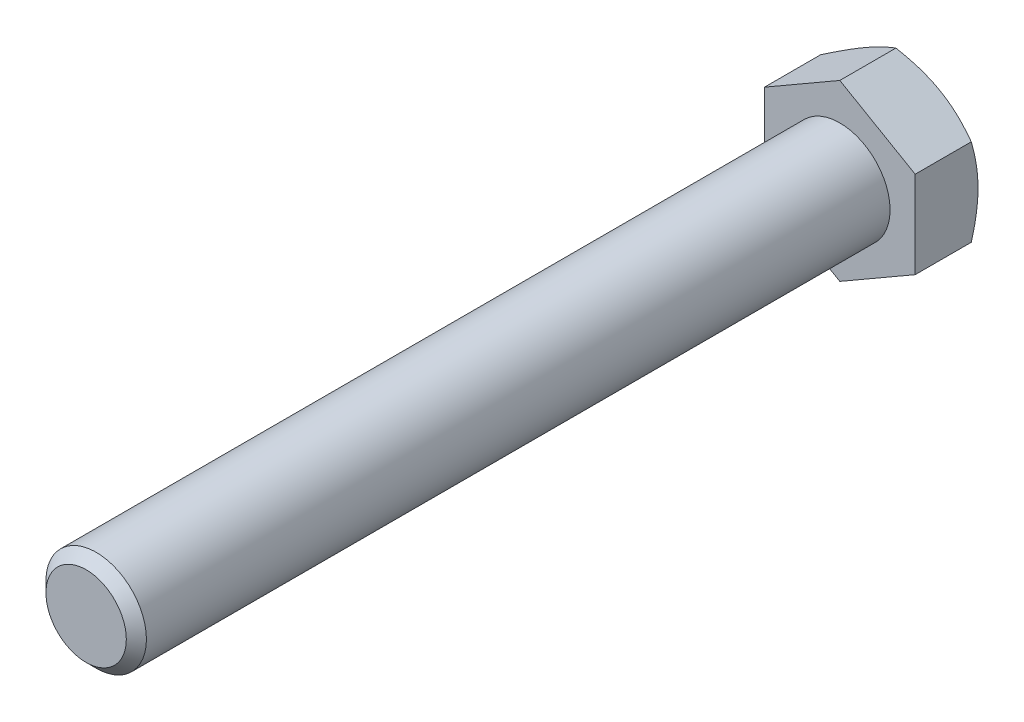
ISO-10303-21;
HEADER;
FILE_DESCRIPTION(('STEP AP214'),'2;1');
FILE_NAME('part.step','',(''),(''),'','','');
FILE_SCHEMA(('AUTOMOTIVE_DESIGN { 1 0 10303 214 1 1 1 1 }'));
ENDSEC;
DATA;
#1=APPLICATION_CONTEXT('core data for automotive mechanical design processes');
#2=APPLICATION_PROTOCOL_DEFINITION('international standard','automotive_design',2000,#1);
#3=PRODUCT_CONTEXT('',#1,'mechanical');
#4=PRODUCT('Part','Part','',(#3));
#5=PRODUCT_RELATED_PRODUCT_CATEGORY('part','',(#4));
#6=PRODUCT_DEFINITION_FORMATION('','',#4);
#7=PRODUCT_DEFINITION_CONTEXT('part definition',#1,'design');
#8=PRODUCT_DEFINITION('design','',#6,#7);
#9=PRODUCT_DEFINITION_SHAPE('','',#8);
#10=(LENGTH_UNIT() NAMED_UNIT(*) SI_UNIT(.MILLI.,.METRE.));
#11=(NAMED_UNIT(*) PLANE_ANGLE_UNIT() SI_UNIT($,.RADIAN.));
#12=(NAMED_UNIT(*) SI_UNIT($,.STERADIAN.) SOLID_ANGLE_UNIT());
#13=UNCERTAINTY_MEASURE_WITH_UNIT(LENGTH_MEASURE(1.E-05),#10,'distance_accuracy_value','');
#14=(GEOMETRIC_REPRESENTATION_CONTEXT(3) GLOBAL_UNCERTAINTY_ASSIGNED_CONTEXT((#13)) GLOBAL_UNIT_ASSIGNED_CONTEXT((#10,
#11,#12)) REPRESENTATION_CONTEXT('',''));
#15=CARTESIAN_POINT('',(0.,0.,0.));
#16=DIRECTION('',(0.,0.,1.));
#17=DIRECTION('',(1.,0.,0.));
#18=AXIS2_PLACEMENT_3D('',#15,#16,#17);
#19=CARTESIAN_POINT('',(0.,0.,90.));
#20=DIRECTION('',(0.,0.,1.));
#21=DIRECTION('',(1.,0.,0.));
#22=AXIS2_PLACEMENT_3D('',#19,#20,#21);
#23=PLANE('',#22);
#24=CARTESIAN_POINT('',(0.,0.,90.));
#25=DIRECTION('',(0.,0.,1.));
#26=DIRECTION('',(1.,0.,0.));
#27=AXIS2_PLACEMENT_3D('',#24,#25,#26);
#28=CIRCLE('',#27,4.80000000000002);
#29=CARTESIAN_POINT('',(4.80000000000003,0.,90.));
#30=VERTEX_POINT('',#29);
#31=EDGE_CURVE('E268',#30,#30,#28,.T.);
#32=ORIENTED_EDGE('',*,*,#31,.T.);
#33=EDGE_LOOP('',(#32));
#34=FACE_BOUND('',#33,.T.);
#35=ADVANCED_FACE('F37',(#34),#23,.T.);
#36=CARTESIAN_POINT('',(0.,0.,0.));
#37=DIRECTION('',(0.,0.,1.));
#38=DIRECTION('',(1.,0.,0.));
#39=AXIS2_PLACEMENT_3D('',#36,#37,#38);
#40=CYLINDRICAL_SURFACE('',#39,6.);
#41=CARTESIAN_POINT('',(0.,0.,88.8));
#42=DIRECTION('',(0.,0.,1.));
#43=DIRECTION('',(1.,0.,0.));
#44=AXIS2_PLACEMENT_3D('',#41,#42,#43);
#45=CIRCLE('',#44,6.);
#46=CARTESIAN_POINT('',(6.00000000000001,0.,88.8));
#47=VERTEX_POINT('',#46);
#48=EDGE_CURVE('E239',#47,#47,#45,.F.);
#49=ORIENTED_EDGE('',*,*,#48,.T.);
#50=EDGE_LOOP('',(#49));
#51=FACE_BOUND('',#50,.T.);
#52=CARTESIAN_POINT('',(0.,0.,0.));
#53=DIRECTION('',(0.,0.,1.));
#54=DIRECTION('',(1.,0.,0.));
#55=AXIS2_PLACEMENT_3D('',#52,#53,#54);
#56=CIRCLE('',#55,6.);
#57=CARTESIAN_POINT('',(6.,0.,0.));
#58=VERTEX_POINT('',#57);
#59=EDGE_CURVE('E265',#58,#58,#56,.F.);
#60=ORIENTED_EDGE('',*,*,#59,.F.);
#61=EDGE_LOOP('',(#60));
#62=FACE_BOUND('',#61,.T.);
#63=ADVANCED_FACE('F203',(#51,#62),#40,.T.);
#64=CARTESIAN_POINT('',(0.,0.,90.));
#65=DIRECTION('',(0.,0.,-1.));
#66=DIRECTION('',(-1.,0.,0.));
#67=AXIS2_PLACEMENT_3D('',#64,#65,#66);
#68=CONICAL_SURFACE('',#67,4.80000000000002,0.785398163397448);
#69=ORIENTED_EDGE('',*,*,#48,.F.);
#70=EDGE_LOOP('',(#69));
#71=FACE_BOUND('',#70,.T.);
#72=ORIENTED_EDGE('',*,*,#31,.F.);
#73=EDGE_LOOP('',(#72));
#74=FACE_BOUND('',#73,.T.);
#75=ADVANCED_FACE('F39',(#71,#74),#68,.T.);
#76=CARTESIAN_POINT('',(0.,10.3923048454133,-7.5));
#77=DIRECTION('',(0.499999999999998,0.86602540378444,0.));
#78=DIRECTION('',(-0.86602540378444,0.499999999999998,0.));
#79=AXIS2_PLACEMENT_3D('',#76,#77,#78);
#80=PLANE('',#79);
#81=CARTESIAN_POINT('',(-0.00020000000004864,10.3924203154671,-6.69608575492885));
#82=CARTESIAN_POINT('',(0.197607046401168,10.2782163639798,-6.76201799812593));
#83=CARTESIAN_POINT('',(0.396185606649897,10.1635669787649,-6.82495859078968));
#84=CARTESIAN_POINT('',(0.794955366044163,9.93333715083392,-6.94403100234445));
#85=CARTESIAN_POINT('',(0.995147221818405,9.8177563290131,-7.00015988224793));
#86=CARTESIAN_POINT('',(1.39751505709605,9.5854491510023,-7.10484803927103));
#87=CARTESIAN_POINT('',(1.59969459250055,9.46872074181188,-7.15338922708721));
#88=CARTESIAN_POINT('',(2.0054287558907,9.23447001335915,-7.24185148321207));
#89=CARTESIAN_POINT('',(2.20898309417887,9.11694786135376,-7.28177431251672));
#90=CARTESIAN_POINT('',(2.61230590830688,8.88408932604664,-7.35131532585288));
#91=CARTESIAN_POINT('',(2.81204459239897,8.76877014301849,-7.3811624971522));
#92=CARTESIAN_POINT('',(3.21241567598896,8.53761579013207,-7.43120669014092));
#93=CARTESIAN_POINT('',(3.41304799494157,8.42178066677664,-7.45140456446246));
#94=CARTESIAN_POINT('',(3.81466063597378,8.18990950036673,-7.48164565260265));
#95=CARTESIAN_POINT('',(4.0156403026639,8.07387383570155,-7.4917003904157));
#96=CARTESIAN_POINT('',(4.41778459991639,7.84169571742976,-7.50143766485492));
#97=CARTESIAN_POINT('',(4.61894922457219,7.7255532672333,-7.50112052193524));
#98=CARTESIAN_POINT('',(4.99503261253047,7.50842142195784,-7.49083604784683));
#99=CARTESIAN_POINT('',(5.16997789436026,7.40741671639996,-7.4821232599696));
#100=CARTESIAN_POINT('',(5.51945867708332,7.2056438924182,-7.45702265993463));
#101=CARTESIAN_POINT('',(5.69399414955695,7.10487579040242,-7.44063433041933));
#102=CARTESIAN_POINT('',(6.21692487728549,6.80296159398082,-7.38034344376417));
#103=CARTESIAN_POINT('',(6.5643945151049,6.60234990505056,-7.32532251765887));
#104=CARTESIAN_POINT('',(7.26301962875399,6.19899850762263,-7.18776952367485));
#105=CARTESIAN_POINT('',(7.61408594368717,5.99631027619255,-7.10465438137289));
#106=CARTESIAN_POINT('',(8.3109833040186,5.59395639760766,-6.91601746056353));
#107=CARTESIAN_POINT('',(8.65682327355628,5.39428559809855,-6.81053998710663));
#108=CARTESIAN_POINT('',(9.0002,5.19603695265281,-6.69608575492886));
#109=B_SPLINE_CURVE_WITH_KNOTS('',3,(#81,#82,#83,#84,#85,#86,#87,#88,#89,#90,#91,#92,#93,#94,
#95,#96,#97,#98,#99,#100,#101,#102,#103,#104,#105,#106,#107,#108),.UNSPECIFIED.,.F.,.F.,(4,2,2,
2,2,2,2,2,2,2,2,2,2,4),(0.,0.713219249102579,1.42674513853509,2.14194697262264,2.85700253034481,
3.55449749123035,4.25193080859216,4.94857085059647,5.64518936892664,6.25162976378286,
6.85811104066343,8.07193747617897,9.31268391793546,10.5509947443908),.UNSPECIFIED.);
#110=CARTESIAN_POINT('',(0.,10.3923048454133,-6.69615242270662));
#111=VERTEX_POINT('',#110);
#112=CARTESIAN_POINT('',(4.49999999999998,7.79422863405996,-7.5));
#113=VERTEX_POINT('',#112);
#114=EDGE_CURVE('E227',#111,#113,#109,.T.);
#115=ORIENTED_EDGE('',*,*,#114,.F.);
#116=DIRECTION('',(0.,0.,1.));
#117=VECTOR('',#116,1.);
#118=CARTESIAN_POINT('',(0.,10.3923048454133,-7.5));
#119=LINE('',#118,#117);
#120=CARTESIAN_POINT('',(0.,10.3923048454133,0.));
#121=VERTEX_POINT('',#120);
#122=EDGE_CURVE('E224',#111,#121,#119,.T.);
#123=ORIENTED_EDGE('',*,*,#122,.T.);
#124=DIRECTION('',(-0.86602540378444,0.499999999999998,0.));
#125=VECTOR('',#124,1.);
#126=CARTESIAN_POINT('',(0.,10.3923048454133,0.));
#127=LINE('',#126,#125);
#128=CARTESIAN_POINT('',(9.00000000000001,5.19615242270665,0.));
#129=VERTEX_POINT('',#128);
#130=EDGE_CURVE('E232',#129,#121,#127,.T.);
#131=ORIENTED_EDGE('',*,*,#130,.F.);
#132=DIRECTION('',(0.,0.,1.));
#133=VECTOR('',#132,1.);
#134=CARTESIAN_POINT('',(9.00000000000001,5.19615242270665,-7.5));
#135=LINE('',#134,#133);
#136=CARTESIAN_POINT('',(9.00000000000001,5.19615242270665,-6.69615242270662));
#137=VERTEX_POINT('',#136);
#138=EDGE_CURVE('E257',#137,#129,#135,.T.);
#139=ORIENTED_EDGE('',*,*,#138,.F.);
#140=EDGE_CURVE('E177',#113,#137,#109,.T.);
#141=ORIENTED_EDGE('',*,*,#140,.F.);
#142=EDGE_LOOP('',(#115,#123,#131,#139,#141));
#143=FACE_BOUND('',#142,.T.);
#144=ADVANCED_FACE('F187',(#143),#80,.T.);
#145=CARTESIAN_POINT('',(9.00000000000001,-5.19615242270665,-7.5));
#146=DIRECTION('',(1.,0.,0.));
#147=DIRECTION('',(0.,0.,-1.));
#148=AXIS2_PLACEMENT_3D('',#145,#146,#147);
#149=PLANE('',#148);
#150=CARTESIAN_POINT('',(9.00000000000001,-14.1938054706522,-2.99281770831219));
#151=CARTESIAN_POINT('',(9.00000000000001,-13.7986249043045,-3.18545400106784));
#152=CARTESIAN_POINT('',(9.00000000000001,-13.4025620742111,-3.37631016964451));
#153=CARTESIAN_POINT('',(9.00000000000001,-12.6082034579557,-3.75346543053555));
#154=CARTESIAN_POINT('',(9.00000000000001,-12.2099073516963,-3.93976384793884));
#155=CARTESIAN_POINT('',(9.00000000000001,-11.4086732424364,-4.30769386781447));
#156=CARTESIAN_POINT('',(9.00000000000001,-11.005721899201,-4.48929651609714));
#157=CARTESIAN_POINT('',(9.00000000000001,-10.1966954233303,-4.84537774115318));
#158=CARTESIAN_POINT('',(9.00000000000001,-9.79062043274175,-5.01985663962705));
#159=CARTESIAN_POINT('',(9.00000000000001,-8.96081603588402,-5.36560228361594));
#160=CARTESIAN_POINT('',(9.00000000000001,-8.53695616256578,-5.5365575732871));
#161=CARTESIAN_POINT('',(9.00000000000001,-7.68436682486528,-5.86609252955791));
#162=CARTESIAN_POINT('',(9.00000000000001,-7.25563683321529,-6.02467084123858));
#163=CARTESIAN_POINT('',(9.00000000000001,-6.39334839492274,-6.3254614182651));
#164=CARTESIAN_POINT('',(9.00000000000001,-5.95980093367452,-6.46770484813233));
#165=CARTESIAN_POINT('',(9.00000000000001,-5.08650675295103,-6.73142002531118));
#166=CARTESIAN_POINT('',(9.00000000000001,-4.64676195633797,-6.85289806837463));
#167=CARTESIAN_POINT('',(9.00000000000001,-3.7631885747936,-7.06875933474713));
#168=CARTESIAN_POINT('',(9.00000000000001,-3.31939822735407,-7.16329494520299));
#169=CARTESIAN_POINT('',(9.00000000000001,-2.64948950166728,-7.28091249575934));
#170=CARTESIAN_POINT('',(9.00000000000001,-2.42546830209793,-7.31608884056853));
#171=CARTESIAN_POINT('',(9.00000000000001,-1.97623392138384,-7.37769613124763));
#172=CARTESIAN_POINT('',(9.00000000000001,-1.75102085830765,-7.40412792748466));
#173=CARTESIAN_POINT('',(9.00000000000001,-1.30274989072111,-7.44737513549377));
#174=CARTESIAN_POINT('',(9.00000000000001,-1.07970414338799,-7.46431601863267));
#175=CARTESIAN_POINT('',(9.00000000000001,-0.633095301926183,-7.4887410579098));
#176=CARTESIAN_POINT('',(9.00000000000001,-0.409532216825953,-7.49622537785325));
#177=CARTESIAN_POINT('',(9.00000000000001,0.0377121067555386,-7.50155767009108));
#178=CARTESIAN_POINT('',(9.00000000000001,0.261393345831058,-7.49940559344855));
#179=CARTESIAN_POINT('',(9.00000000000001,0.708460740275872,-7.48552018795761));
#180=CARTESIAN_POINT('',(9.00000000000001,0.931846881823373,-7.47378642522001));
#181=CARTESIAN_POINT('',(9.00000000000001,1.46162752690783,-7.43485039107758));
#182=CARTESIAN_POINT('',(9.00000000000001,1.76772399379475,-7.40349650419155));
#183=CARTESIAN_POINT('',(9.00000000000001,2.37778404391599,-7.32445593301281));
#184=CARTESIAN_POINT('',(9.00000000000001,2.6817473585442,-7.27676722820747));
#185=CARTESIAN_POINT('',(9.00000000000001,3.59000335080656,-7.1117163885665));
#186=CARTESIAN_POINT('',(9.00000000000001,4.19036603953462,-6.9723942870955));
#187=CARTESIAN_POINT('',(9.00000000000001,5.08858153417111,-6.72898039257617));
#188=CARTESIAN_POINT('',(9.00000000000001,5.39104017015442,-6.64089135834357));
#189=CARTESIAN_POINT('',(9.00000000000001,5.99302412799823,-6.4551143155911));
#190=CARTESIAN_POINT('',(9.00000000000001,6.29254942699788,-6.35742623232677));
#191=CARTESIAN_POINT('',(9.00000000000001,6.88875586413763,-6.15405553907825));
#192=CARTESIAN_POINT('',(9.00000000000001,7.18543776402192,-6.0483751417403));
#193=CARTESIAN_POINT('',(9.00000000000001,7.77631041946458,-5.83030807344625));
#194=CARTESIAN_POINT('',(9.00000000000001,8.07050123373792,-5.71792156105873));
#195=CARTESIAN_POINT('',(9.00000000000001,8.86768097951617,-5.40462740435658));
#196=CARTESIAN_POINT('',(9.00000000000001,9.36851420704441,-5.19823951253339));
#197=CARTESIAN_POINT('',(9.00000000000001,10.3649647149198,-4.77318997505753));
#198=CARTESIAN_POINT('',(9.00000000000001,10.860581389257,-4.5545269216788));
#199=CARTESIAN_POINT('',(9.00000000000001,11.8478077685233,-4.10785524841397));
#200=CARTESIAN_POINT('',(9.00000000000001,12.3394158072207,-3.87984295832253));
#201=CARTESIAN_POINT('',(9.00000000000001,13.3192435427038,-3.41672758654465));
#202=CARTESIAN_POINT('',(9.00000000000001,13.8074633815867,-3.18162480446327));
#203=CARTESIAN_POINT('',(9.00000000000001,14.7819931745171,-2.70549247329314));
#204=CARTESIAN_POINT('',(9.00000000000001,15.2682986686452,-2.46445381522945));
#205=CARTESIAN_POINT('',(9.00000000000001,16.2387067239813,-1.97797920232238));
#206=CARTESIAN_POINT('',(9.00000000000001,16.7228092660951,-1.73254320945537));
#207=CARTESIAN_POINT('',(9.00000000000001,17.6890969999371,-1.23819989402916));
#208=CARTESIAN_POINT('',(9.00000000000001,18.1712826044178,-0.989293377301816));
#209=CARTESIAN_POINT('',(9.00000000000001,19.1341609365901,-0.48860773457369));
#210=CARTESIAN_POINT('',(9.00000000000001,19.6148536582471,-0.236828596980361));
#211=CARTESIAN_POINT('',(9.00000000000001,20.9522159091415,0.46783942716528));
#212=CARTESIAN_POINT('',(9.00000000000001,21.8075292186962,0.92330168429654));
#213=CARTESIAN_POINT('',(9.00000000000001,23.5152984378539,1.83966951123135));
#214=CARTESIAN_POINT('',(9.00000000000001,24.3677541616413,2.3005754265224));
#215=CARTESIAN_POINT('',(9.00000000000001,26.0675482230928,3.22485857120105));
#216=CARTESIAN_POINT('',(9.00000000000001,26.9148940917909,3.68822195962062));
#217=CARTESIAN_POINT('',(9.00000000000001,28.1846057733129,4.38556367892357));
#218=CARTESIAN_POINT('',(9.00000000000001,28.6076082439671,4.61838432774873));
#219=CARTESIAN_POINT('',(9.00000000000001,29.4532343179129,5.08471147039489));
#220=CARTESIAN_POINT('',(9.00000000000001,29.8758579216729,5.31821796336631));
#221=CARTESIAN_POINT('',(9.00000000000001,30.2983153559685,5.55202477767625));
#222=B_SPLINE_CURVE_WITH_KNOTS('',3,(#150,#151,#152,#153,#154,#155,#156,#157,#158,#159,#160,
#161,#162,#163,#164,#165,#166,#167,#168,#169,#170,#171,#172,#173,#174,#175,#176,#177,#178,#179,
#180,#181,#182,#183,#184,#185,#186,#187,#188,#189,#190,#191,#192,#193,#194,#195,#196,#197,#198,
#199,#200,#201,#202,#203,#204,#205,#206,#207,#208,#209,#210,#211,#212,#213,#214,#215,#216,#217,
#218,#219,#220,#221),.UNSPECIFIED.,.F.,.F.,(4,2,2,2,2,2,2,2,2,2,2,2,2,2,2,2,2,2,2,2,2,2,2,2,2,2,
2,2,2,2,2,2,2,2,2,4),(0.,1.31891143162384,2.63801699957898,3.9639117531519,5.28974656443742,
6.66070766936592,8.03181864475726,9.40026868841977,10.7683030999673,12.1284389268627,
12.8085936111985,13.488682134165,14.1595537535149,14.8304137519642,15.5012771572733,
16.172170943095,17.094749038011,18.0174412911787,19.8637129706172,20.808703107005,
21.7537006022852,22.6984374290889,23.6431519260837,25.267980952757,26.8929966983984,
28.5186565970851,30.1442479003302,31.7725119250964,33.4007900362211,35.0286961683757,
36.6566088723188,39.5636489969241,42.4708746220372,45.3681585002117,46.8166845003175,
48.2652087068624),.UNSPECIFIED.);
#223=CARTESIAN_POINT('',(9.,0.,-7.5));
#224=VERTEX_POINT('',#223);
#225=EDGE_CURVE('E175',#137,#224,#222,.F.);
#226=ORIENTED_EDGE('',*,*,#225,.F.);
#227=ORIENTED_EDGE('',*,*,#138,.T.);
#228=DIRECTION('',(0.,1.,0.));
#229=VECTOR('',#228,1.);
#230=CARTESIAN_POINT('',(9.00000000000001,-5.19615242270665,0.));
#231=LINE('',#230,#229);
#232=CARTESIAN_POINT('',(9.00000000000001,-5.19615242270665,0.));
#233=VERTEX_POINT('',#232);
#234=EDGE_CURVE('E264',#233,#129,#231,.T.);
#235=ORIENTED_EDGE('',*,*,#234,.F.);
#236=DIRECTION('',(0.,0.,1.));
#237=VECTOR('',#236,1.);
#238=CARTESIAN_POINT('',(9.00000000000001,-5.19615242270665,-7.5));
#239=LINE('',#238,#237);
#240=CARTESIAN_POINT('',(9.00000000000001,-5.19615242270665,-6.69615242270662));
#241=VERTEX_POINT('',#240);
#242=EDGE_CURVE('E242',#241,#233,#239,.T.);
#243=ORIENTED_EDGE('',*,*,#242,.F.);
#244=EDGE_CURVE('E170',#224,#241,#222,.F.);
#245=ORIENTED_EDGE('',*,*,#244,.F.);
#246=EDGE_LOOP('',(#226,#227,#235,#243,#245));
#247=FACE_BOUND('',#246,.T.);
#248=ADVANCED_FACE('F183',(#247),#149,.T.);
#249=CARTESIAN_POINT('',(0.,-10.3923048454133,-7.5));
#250=DIRECTION('',(0.499999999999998,-0.86602540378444,0.));
#251=DIRECTION('',(0.86602540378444,0.499999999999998,0.));
#252=AXIS2_PLACEMENT_3D('',#249,#250,#251);
#253=PLANE('',#252);
#254=CARTESIAN_POINT('',(9.0002,-5.19603695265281,-6.69608575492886));
#255=CARTESIAN_POINT('',(8.80239295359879,-5.31024090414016,-6.76201799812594));
#256=CARTESIAN_POINT('',(8.60381439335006,-5.42489028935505,-6.82495859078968));
#257=CARTESIAN_POINT('',(8.20504463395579,-5.65512011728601,-6.94403100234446));
#258=CARTESIAN_POINT('',(8.00485277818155,-5.77070093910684,-7.00015988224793));
#259=CARTESIAN_POINT('',(7.6024849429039,-6.00300811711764,-7.10484803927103));
#260=CARTESIAN_POINT('',(7.4003054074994,-6.11973652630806,-7.15338922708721));
#261=CARTESIAN_POINT('',(6.99457124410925,-6.35398725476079,-7.24185148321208));
#262=CARTESIAN_POINT('',(6.79101690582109,-6.47150940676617,-7.28177431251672));
#263=CARTESIAN_POINT('',(6.38769409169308,-6.70436794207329,-7.35131532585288));
#264=CARTESIAN_POINT('',(6.18795540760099,-6.81968712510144,-7.3811624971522));
#265=CARTESIAN_POINT('',(5.787584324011,-7.05084147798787,-7.43120669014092));
#266=CARTESIAN_POINT('',(5.58695200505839,-7.16667660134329,-7.45140456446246));
#267=CARTESIAN_POINT('',(5.18533936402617,-7.3985477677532,-7.48164565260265));
#268=CARTESIAN_POINT('',(4.98435969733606,-7.51458343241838,-7.4917003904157));
#269=CARTESIAN_POINT('',(4.58221540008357,-7.74676155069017,-7.50143766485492));
#270=CARTESIAN_POINT('',(4.38105077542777,-7.86290400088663,-7.50112052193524));
#271=CARTESIAN_POINT('',(4.00496738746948,-8.08003584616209,-7.49083604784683));
#272=CARTESIAN_POINT('',(3.83002210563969,-8.18104055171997,-7.4821232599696));
#273=CARTESIAN_POINT('',(3.48054132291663,-8.38281337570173,-7.45702265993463));
#274=CARTESIAN_POINT('',(3.30600585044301,-8.48358147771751,-7.44063433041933));
#275=CARTESIAN_POINT('',(2.78307512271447,-8.78549567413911,-7.38034344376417));
#276=CARTESIAN_POINT('',(2.43560548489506,-8.98610736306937,-7.32532251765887));
#277=CARTESIAN_POINT('',(1.73698037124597,-9.38945876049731,-7.18776952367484));
#278=CARTESIAN_POINT('',(1.38591405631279,-9.59214699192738,-7.10465438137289));
#279=CARTESIAN_POINT('',(0.689016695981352,-9.99450087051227,-6.91601746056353));
#280=CARTESIAN_POINT('',(0.343176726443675,-10.1941716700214,-6.81053998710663));
#281=CARTESIAN_POINT('',(-0.000200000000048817,-10.3924203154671,-6.69608575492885));
#282=B_SPLINE_CURVE_WITH_KNOTS('',3,(#254,#255,#256,#257,#258,#259,#260,#261,#262,#263,#264,
#265,#266,#267,#268,#269,#270,#271,#272,#273,#274,#275,#276,#277,#278,#279,#280,#281),
.UNSPECIFIED.,.F.,.F.,(4,2,2,2,2,2,2,2,2,2,2,2,2,4),(0.,0.71321924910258,1.42674513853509,
2.14194697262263,2.85700253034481,3.55449749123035,4.25193080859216,4.94857085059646,
5.64518936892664,6.25162976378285,6.85811104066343,8.07193747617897,9.31268391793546,
10.5509947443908),.UNSPECIFIED.);
#283=CARTESIAN_POINT('',(4.49999999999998,-7.79422863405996,-7.5));
#284=VERTEX_POINT('',#283);
#285=EDGE_CURVE('E176',#241,#284,#282,.T.);
#286=ORIENTED_EDGE('',*,*,#285,.F.);
#287=ORIENTED_EDGE('',*,*,#242,.T.);
#288=DIRECTION('',(0.86602540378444,0.499999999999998,0.));
#289=VECTOR('',#288,1.);
#290=CARTESIAN_POINT('',(0.,-10.3923048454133,0.));
#291=LINE('',#290,#289);
#292=CARTESIAN_POINT('',(0.,-10.3923048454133,0.));
#293=VERTEX_POINT('',#292);
#294=EDGE_CURVE('E253',#293,#233,#291,.T.);
#295=ORIENTED_EDGE('',*,*,#294,.F.);
#296=DIRECTION('',(0.,0.,1.));
#297=VECTOR('',#296,1.);
#298=CARTESIAN_POINT('',(0.,-10.3923048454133,-7.5));
#299=LINE('',#298,#297);
#300=CARTESIAN_POINT('',(0.,-10.3923048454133,-6.69615242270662));
#301=VERTEX_POINT('',#300);
#302=EDGE_CURVE('E252',#301,#293,#299,.T.);
#303=ORIENTED_EDGE('',*,*,#302,.F.);
#304=EDGE_CURVE('E164',#284,#301,#282,.T.);
#305=ORIENTED_EDGE('',*,*,#304,.F.);
#306=EDGE_LOOP('',(#286,#287,#295,#303,#305));
#307=FACE_BOUND('',#306,.T.);
#308=ADVANCED_FACE('F186',(#307),#253,.T.);
#309=CARTESIAN_POINT('',(0.,-10.3923048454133,-7.5));
#310=DIRECTION('',(-0.500000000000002,-0.866025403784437,0.));
#311=DIRECTION('',(0.866025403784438,-0.500000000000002,0.));
#312=AXIS2_PLACEMENT_3D('',#309,#310,#311);
#313=PLANE('',#312);
#314=CARTESIAN_POINT('',(0.000199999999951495,-10.3924203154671,-6.69608575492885));
#315=CARTESIAN_POINT('',(-0.197607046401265,-10.2782163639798,-6.76201799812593));
#316=CARTESIAN_POINT('',(-0.396185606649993,-10.1635669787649,-6.82495859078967));
#317=CARTESIAN_POINT('',(-0.794955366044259,-9.93333715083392,-6.94403100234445));
#318=CARTESIAN_POINT('',(-0.9951472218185,-9.81775632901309,-7.00015988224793));
#319=CARTESIAN_POINT('',(-1.39751505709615,-9.58544915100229,-7.10484803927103));
#320=CARTESIAN_POINT('',(-1.59969459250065,-9.46872074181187,-7.1533892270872));
#321=CARTESIAN_POINT('',(-2.0054287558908,-9.23447001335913,-7.24185148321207));
#322=CARTESIAN_POINT('',(-2.20898309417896,-9.11694786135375,-7.28177431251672));
#323=CARTESIAN_POINT('',(-2.61230590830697,-8.88408932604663,-7.35131532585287));
#324=CARTESIAN_POINT('',(-2.81204459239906,-8.76877014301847,-7.38116249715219));
#325=CARTESIAN_POINT('',(-3.21241567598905,-8.53761579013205,-7.43120669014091));
#326=CARTESIAN_POINT('',(-3.41304799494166,-8.42178066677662,-7.45140456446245));
#327=CARTESIAN_POINT('',(-3.81466063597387,-8.18990950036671,-7.48164565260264));
#328=CARTESIAN_POINT('',(-4.01564030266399,-8.07387383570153,-7.49170039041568));
#329=CARTESIAN_POINT('',(-4.41778459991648,-7.84169571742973,-7.5014376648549));
#330=CARTESIAN_POINT('',(-4.61894922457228,-7.72555326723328,-7.50112052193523));
#331=CARTESIAN_POINT('',(-4.99503261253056,-7.50842142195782,-7.49083604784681));
#332=CARTESIAN_POINT('',(-5.16997789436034,-7.40741671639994,-7.48212325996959));
#333=CARTESIAN_POINT('',(-5.51945867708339,-7.20564389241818,-7.45702265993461));
#334=CARTESIAN_POINT('',(-5.69399414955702,-7.1048757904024,-7.44063433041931));
#335=CARTESIAN_POINT('',(-6.21692487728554,-6.8029615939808,-7.38034344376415));
#336=CARTESIAN_POINT('',(-6.56439451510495,-6.60234990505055,-7.32532251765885));
#337=CARTESIAN_POINT('',(-7.26301962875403,-6.19899850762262,-7.18776952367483));
#338=CARTESIAN_POINT('',(-7.6140859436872,-5.99631027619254,-7.10465438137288));
#339=CARTESIAN_POINT('',(-8.31098330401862,-5.59395639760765,-6.91601746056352));
#340=CARTESIAN_POINT('',(-8.65682327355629,-5.39428559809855,-6.81053998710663));
#341=CARTESIAN_POINT('',(-9.0002,-5.19603695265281,-6.69608575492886));
#342=B_SPLINE_CURVE_WITH_KNOTS('',3,(#314,#315,#316,#317,#318,#319,#320,#321,#322,#323,#324,
#325,#326,#327,#328,#329,#330,#331,#332,#333,#334,#335,#336,#337,#338,#339,#340,#341),
.UNSPECIFIED.,.F.,.F.,(4,2,2,2,2,2,2,2,2,2,2,2,2,4),(0.,0.713219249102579,1.42674513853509,
2.14194697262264,2.85700253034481,3.55449749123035,4.25193080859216,4.94857085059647,
5.64518936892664,6.25162976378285,6.85811104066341,8.07193747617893,9.31268391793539,
10.5509947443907),.UNSPECIFIED.);
#343=CARTESIAN_POINT('',(-4.50000000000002,-7.79422863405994,-7.5));
#344=VERTEX_POINT('',#343);
#345=EDGE_CURVE('E248',#301,#344,#342,.T.);
#346=ORIENTED_EDGE('',*,*,#345,.F.);
#347=ORIENTED_EDGE('',*,*,#302,.T.);
#348=DIRECTION('',(0.866025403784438,-0.500000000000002,0.));
#349=VECTOR('',#348,1.);
#350=CARTESIAN_POINT('',(0.,-10.3923048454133,0.));
#351=LINE('',#350,#349);
#352=CARTESIAN_POINT('',(-9.00000000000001,-5.19615242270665,0.));
#353=VERTEX_POINT('',#352);
#354=EDGE_CURVE('E390',#353,#293,#351,.T.);
#355=ORIENTED_EDGE('',*,*,#354,.F.);
#356=DIRECTION('',(0.,0.,1.));
#357=VECTOR('',#356,1.);
#358=CARTESIAN_POINT('',(-9.00000000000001,-5.19615242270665,-7.5));
#359=LINE('',#358,#357);
#360=CARTESIAN_POINT('',(-9.00000000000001,-5.19615242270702,-6.69615242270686));
#361=VERTEX_POINT('',#360);
#362=EDGE_CURVE('E255',#361,#353,#359,.T.);
#363=ORIENTED_EDGE('',*,*,#362,.F.);
#364=EDGE_CURVE('E114',#344,#361,#342,.T.);
#365=ORIENTED_EDGE('',*,*,#364,.F.);
#366=EDGE_LOOP('',(#346,#347,#355,#363,#365));
#367=FACE_BOUND('',#366,.T.);
#368=ADVANCED_FACE('F192',(#367),#313,.T.);
#369=CARTESIAN_POINT('',(-9.00000000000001,-5.19615242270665,-7.5));
#370=DIRECTION('',(-1.,0.,0.));
#371=DIRECTION('',(0.,0.,1.));
#372=AXIS2_PLACEMENT_3D('',#369,#370,#371);
#373=PLANE('',#372);
#374=CARTESIAN_POINT('',(-9.00000000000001,-14.1938054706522,-2.99281770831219));
#375=CARTESIAN_POINT('',(-9.00000000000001,-13.7986249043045,-3.18545400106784));
#376=CARTESIAN_POINT('',(-9.00000000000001,-13.4025620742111,-3.37631016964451));
#377=CARTESIAN_POINT('',(-9.00000000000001,-12.6082034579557,-3.75346543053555));
#378=CARTESIAN_POINT('',(-9.00000000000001,-12.2099073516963,-3.93976384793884));
#379=CARTESIAN_POINT('',(-9.00000000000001,-11.4086732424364,-4.30769386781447));
#380=CARTESIAN_POINT('',(-9.00000000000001,-11.005721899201,-4.48929651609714));
#381=CARTESIAN_POINT('',(-9.00000000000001,-10.1966954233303,-4.84537774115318));
#382=CARTESIAN_POINT('',(-9.00000000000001,-9.79062043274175,-5.01985663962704));
#383=CARTESIAN_POINT('',(-9.00000000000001,-8.96081603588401,-5.36560228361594));
#384=CARTESIAN_POINT('',(-9.00000000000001,-8.53695616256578,-5.5365575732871));
#385=CARTESIAN_POINT('',(-9.00000000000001,-7.68436682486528,-5.86609252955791));
#386=CARTESIAN_POINT('',(-9.00000000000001,-7.25563683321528,-6.02467084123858));
#387=CARTESIAN_POINT('',(-9.00000000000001,-6.39334839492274,-6.3254614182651));
#388=CARTESIAN_POINT('',(-9.00000000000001,-5.95980093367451,-6.46770484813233));
#389=CARTESIAN_POINT('',(-9.00000000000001,-5.08650675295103,-6.73142002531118));
#390=CARTESIAN_POINT('',(-9.00000000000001,-4.64676195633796,-6.85289806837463));
#391=CARTESIAN_POINT('',(-9.00000000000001,-3.76318857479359,-7.06875933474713));
#392=CARTESIAN_POINT('',(-9.00000000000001,-3.31939822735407,-7.16329494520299));
#393=CARTESIAN_POINT('',(-9.00000000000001,-2.64948950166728,-7.28091249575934));
#394=CARTESIAN_POINT('',(-9.00000000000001,-2.42546830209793,-7.31608884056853));
#395=CARTESIAN_POINT('',(-9.00000000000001,-1.97623392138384,-7.37769613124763));
#396=CARTESIAN_POINT('',(-9.00000000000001,-1.75102085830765,-7.40412792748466));
#397=CARTESIAN_POINT('',(-9.00000000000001,-1.30274989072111,-7.44737513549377));
#398=CARTESIAN_POINT('',(-9.00000000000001,-1.07970414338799,-7.46431601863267));
#399=CARTESIAN_POINT('',(-9.00000000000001,-0.633095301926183,-7.4887410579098));
#400=CARTESIAN_POINT('',(-9.00000000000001,-0.409532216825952,-7.49622537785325));
#401=CARTESIAN_POINT('',(-9.00000000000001,0.0377121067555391,-7.50155767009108));
#402=CARTESIAN_POINT('',(-9.00000000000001,0.261393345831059,-7.49940559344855));
#403=CARTESIAN_POINT('',(-9.00000000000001,0.708460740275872,-7.48552018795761));
#404=CARTESIAN_POINT('',(-9.00000000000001,0.931846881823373,-7.47378642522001));
#405=CARTESIAN_POINT('',(-9.00000000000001,1.46162752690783,-7.43485039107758));
#406=CARTESIAN_POINT('',(-9.00000000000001,1.76772399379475,-7.40349650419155));
#407=CARTESIAN_POINT('',(-9.00000000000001,2.37778404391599,-7.32445593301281));
#408=CARTESIAN_POINT('',(-9.00000000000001,2.6817473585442,-7.27676722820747));
#409=CARTESIAN_POINT('',(-9.00000000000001,3.59000335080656,-7.1117163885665));
#410=CARTESIAN_POINT('',(-9.00000000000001,4.19036603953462,-6.9723942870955));
#411=CARTESIAN_POINT('',(-9.00000000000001,5.08858153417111,-6.72898039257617));
#412=CARTESIAN_POINT('',(-9.00000000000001,5.39104017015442,-6.64089135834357));
#413=CARTESIAN_POINT('',(-9.00000000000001,5.99302412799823,-6.4551143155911));
#414=CARTESIAN_POINT('',(-9.00000000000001,6.29254942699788,-6.35742623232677));
#415=CARTESIAN_POINT('',(-9.00000000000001,6.88875586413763,-6.15405553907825));
#416=CARTESIAN_POINT('',(-9.00000000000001,7.18543776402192,-6.0483751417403));
#417=CARTESIAN_POINT('',(-9.00000000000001,7.77631041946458,-5.83030807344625));
#418=CARTESIAN_POINT('',(-9.00000000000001,8.07050123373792,-5.71792156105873));
#419=CARTESIAN_POINT('',(-9.00000000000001,8.86768097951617,-5.40462740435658));
#420=CARTESIAN_POINT('',(-9.00000000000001,9.36851420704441,-5.19823951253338));
#421=CARTESIAN_POINT('',(-9.00000000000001,10.3649647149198,-4.77318997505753));
#422=CARTESIAN_POINT('',(-9.00000000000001,10.860581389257,-4.55452692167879));
#423=CARTESIAN_POINT('',(-9.00000000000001,11.8478077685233,-4.10785524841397));
#424=CARTESIAN_POINT('',(-9.00000000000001,12.3394158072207,-3.87984295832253));
#425=CARTESIAN_POINT('',(-9.00000000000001,13.3192435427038,-3.41672758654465));
#426=CARTESIAN_POINT('',(-9.00000000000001,13.8074633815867,-3.18162480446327));
#427=CARTESIAN_POINT('',(-9.00000000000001,14.7819931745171,-2.70549247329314));
#428=CARTESIAN_POINT('',(-9.00000000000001,15.2682986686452,-2.46445381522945));
#429=CARTESIAN_POINT('',(-9.00000000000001,16.2387067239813,-1.97797920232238));
#430=CARTESIAN_POINT('',(-9.00000000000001,16.722809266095,-1.73254320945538));
#431=CARTESIAN_POINT('',(-9.00000000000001,17.6890969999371,-1.23819989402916));
#432=CARTESIAN_POINT('',(-9.00000000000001,18.1712826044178,-0.989293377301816));
#433=CARTESIAN_POINT('',(-9.00000000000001,19.1341609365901,-0.48860773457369));
#434=CARTESIAN_POINT('',(-9.00000000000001,19.6148536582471,-0.236828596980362));
#435=CARTESIAN_POINT('',(-9.00000000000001,20.9522159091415,0.467839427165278));
#436=CARTESIAN_POINT('',(-9.00000000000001,21.8075292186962,0.923301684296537));
#437=CARTESIAN_POINT('',(-9.00000000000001,23.5152984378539,1.83966951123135));
#438=CARTESIAN_POINT('',(-9.00000000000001,24.3677541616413,2.3005754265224));
#439=CARTESIAN_POINT('',(-9.00000000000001,26.0675482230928,3.22485857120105));
#440=CARTESIAN_POINT('',(-9.00000000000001,26.9148940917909,3.68822195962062));
#441=CARTESIAN_POINT('',(-9.00000000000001,28.184605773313,4.38556367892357));
#442=CARTESIAN_POINT('',(-9.00000000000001,28.6076082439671,4.61838432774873));
#443=CARTESIAN_POINT('',(-9.00000000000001,29.4532343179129,5.08471147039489));
#444=CARTESIAN_POINT('',(-9.00000000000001,29.8758579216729,5.31821796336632));
#445=CARTESIAN_POINT('',(-9.00000000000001,30.2983153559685,5.55202477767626));
#446=B_SPLINE_CURVE_WITH_KNOTS('',3,(#374,#375,#376,#377,#378,#379,#380,#381,#382,#383,#384,
#385,#386,#387,#388,#389,#390,#391,#392,#393,#394,#395,#396,#397,#398,#399,#400,#401,#402,#403,
#404,#405,#406,#407,#408,#409,#410,#411,#412,#413,#414,#415,#416,#417,#418,#419,#420,#421,#422,
#423,#424,#425,#426,#427,#428,#429,#430,#431,#432,#433,#434,#435,#436,#437,#438,#439,#440,#441,
#442,#443,#444,#445),.UNSPECIFIED.,.F.,.F.,(4,2,2,2,2,2,2,2,2,2,2,2,2,2,2,2,2,2,2,2,2,2,2,2,2,2,
2,2,2,2,2,2,2,2,2,4),(0.,1.31891143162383,2.63801699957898,3.9639117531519,5.28974656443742,
6.66070766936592,8.03181864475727,9.40026868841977,10.7683030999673,12.1284389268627,
12.8085936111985,13.488682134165,14.1595537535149,14.8304137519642,15.5012771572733,
16.172170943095,17.094749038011,18.0174412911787,19.8637129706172,20.808703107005,
21.7537006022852,22.6984374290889,23.6431519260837,25.267980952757,26.8929966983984,
28.5186565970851,30.1442479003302,31.7725119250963,33.400790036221,35.0286961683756,
36.6566088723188,39.5636489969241,42.4708746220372,45.3681585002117,46.8166845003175,
48.2652087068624),.UNSPECIFIED.);
#447=CARTESIAN_POINT('',(-9.00000000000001,0.,-7.5));
#448=VERTEX_POINT('',#447);
#449=EDGE_CURVE('E109',#361,#448,#446,.T.);
#450=ORIENTED_EDGE('',*,*,#449,.F.);
#451=ORIENTED_EDGE('',*,*,#362,.T.);
#452=DIRECTION('',(0.,-1.,0.));
#453=VECTOR('',#452,1.);
#454=CARTESIAN_POINT('',(-9.00000000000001,-5.19615242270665,0.));
#455=LINE('',#454,#453);
#456=CARTESIAN_POINT('',(-9.00000000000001,5.19615242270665,0.));
#457=VERTEX_POINT('',#456);
#458=EDGE_CURVE('E392',#457,#353,#455,.T.);
#459=ORIENTED_EDGE('',*,*,#458,.F.);
#460=DIRECTION('',(0.,0.,1.));
#461=VECTOR('',#460,1.);
#462=CARTESIAN_POINT('',(-9.00000000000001,5.19615242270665,-7.5));
#463=LINE('',#462,#461);
#464=CARTESIAN_POINT('',(-9.00000000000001,5.19615242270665,-6.69615242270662));
#465=VERTEX_POINT('',#464);
#466=EDGE_CURVE('E135',#465,#457,#463,.T.);
#467=ORIENTED_EDGE('',*,*,#466,.F.);
#468=EDGE_CURVE('E118',#448,#465,#446,.T.);
#469=ORIENTED_EDGE('',*,*,#468,.F.);
#470=EDGE_LOOP('',(#450,#451,#459,#467,#469));
#471=FACE_BOUND('',#470,.T.);
#472=ADVANCED_FACE('F133',(#471),#373,.T.);
#473=CARTESIAN_POINT('',(-9.00000000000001,5.19615242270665,-7.5));
#474=DIRECTION('',(-0.500000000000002,0.866025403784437,0.));
#475=DIRECTION('',(-0.866025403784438,-0.500000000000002,0.));
#476=AXIS2_PLACEMENT_3D('',#473,#474,#475);
#477=PLANE('',#476);
#478=CARTESIAN_POINT('',(-9.0002,5.19603695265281,-6.69608575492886));
#479=CARTESIAN_POINT('',(-8.80239295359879,5.31024090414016,-6.76201799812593));
#480=CARTESIAN_POINT('',(-8.60381439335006,5.42489028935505,-6.82495859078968));
#481=CARTESIAN_POINT('',(-8.20504463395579,5.65512011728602,-6.94403100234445));
#482=CARTESIAN_POINT('',(-8.00485277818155,5.77070093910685,-7.00015988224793));
#483=CARTESIAN_POINT('',(-7.6024849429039,6.00300811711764,-7.10484803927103));
#484=CARTESIAN_POINT('',(-7.40030540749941,6.11973652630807,-7.15338922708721));
#485=CARTESIAN_POINT('',(-6.99457124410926,6.3539872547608,-7.24185148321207));
#486=CARTESIAN_POINT('',(-6.79101690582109,6.47150940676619,-7.28177431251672));
#487=CARTESIAN_POINT('',(-6.38769409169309,6.70436794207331,-7.35131532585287));
#488=CARTESIAN_POINT('',(-6.187955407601,6.81968712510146,-7.38116249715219));
#489=CARTESIAN_POINT('',(-5.787584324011,7.05084147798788,-7.43120669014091));
#490=CARTESIAN_POINT('',(-5.58695200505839,7.16667660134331,-7.45140456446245));
#491=CARTESIAN_POINT('',(-5.18533936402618,7.39854776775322,-7.48164565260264));
#492=CARTESIAN_POINT('',(-4.98435969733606,7.5145834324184,-7.49170039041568));
#493=CARTESIAN_POINT('',(-4.58221540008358,7.7467615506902,-7.5014376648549));
#494=CARTESIAN_POINT('',(-4.38105077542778,7.86290400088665,-7.50112052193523));
#495=CARTESIAN_POINT('',(-4.0049673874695,8.08003584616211,-7.49083604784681));
#496=CARTESIAN_POINT('',(-3.83002210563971,8.18104055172,-7.48212325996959));
#497=CARTESIAN_POINT('',(-3.48054132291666,8.38281337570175,-7.45702265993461));
#498=CARTESIAN_POINT('',(-3.30600585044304,8.48358147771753,-7.44063433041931));
#499=CARTESIAN_POINT('',(-2.78307512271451,8.78549567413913,-7.38034344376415));
#500=CARTESIAN_POINT('',(-2.4356054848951,8.98610736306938,-7.32532251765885));
#501=CARTESIAN_POINT('',(-1.73698037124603,9.38945876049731,-7.18776952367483));
#502=CARTESIAN_POINT('',(-1.38591405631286,9.59214699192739,-7.10465438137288));
#503=CARTESIAN_POINT('',(-0.689016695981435,9.99450087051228,-6.91601746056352));
#504=CARTESIAN_POINT('',(-0.343176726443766,10.1941716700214,-6.81053998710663));
#505=CARTESIAN_POINT('',(0.000199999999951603,10.3924203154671,-6.69608575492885));
#506=B_SPLINE_CURVE_WITH_KNOTS('',3,(#478,#479,#480,#481,#482,#483,#484,#485,#486,#487,#488,
#489,#490,#491,#492,#493,#494,#495,#496,#497,#498,#499,#500,#501,#502,#503,#504,#505),
.UNSPECIFIED.,.F.,.F.,(4,2,2,2,2,2,2,2,2,2,2,2,2,4),(0.,0.71321924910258,1.42674513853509,
2.14194697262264,2.85700253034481,3.55449749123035,4.25193080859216,4.94857085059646,
5.64518936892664,6.25162976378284,6.8581110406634,8.07193747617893,9.31268391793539,
10.5509947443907),.UNSPECIFIED.);
#507=CARTESIAN_POINT('',(-4.50000000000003,7.79422863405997,-7.5));
#508=VERTEX_POINT('',#507);
#509=EDGE_CURVE('E124',#465,#508,#506,.T.);
#510=ORIENTED_EDGE('',*,*,#509,.F.);
#511=ORIENTED_EDGE('',*,*,#466,.T.);
#512=DIRECTION('',(-0.866025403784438,-0.500000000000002,0.));
#513=VECTOR('',#512,1.);
#514=CARTESIAN_POINT('',(-9.00000000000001,5.19615242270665,0.));
#515=LINE('',#514,#513);
#516=EDGE_CURVE('E234',#121,#457,#515,.T.);
#517=ORIENTED_EDGE('',*,*,#516,.F.);
#518=ORIENTED_EDGE('',*,*,#122,.F.);
#519=EDGE_CURVE('E126',#508,#111,#506,.T.);
#520=ORIENTED_EDGE('',*,*,#519,.F.);
#521=EDGE_LOOP('',(#510,#511,#517,#518,#520));
#522=FACE_BOUND('',#521,.T.);
#523=ADVANCED_FACE('F200',(#522),#477,.T.);
#524=CARTESIAN_POINT('',(9.00000000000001,5.19615242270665,0.));
#525=DIRECTION('',(0.,0.,1.));
#526=DIRECTION('',(1.,0.,0.));
#527=AXIS2_PLACEMENT_3D('',#524,#525,#526);
#528=PLANE('',#527);
#529=ORIENTED_EDGE('',*,*,#59,.T.);
#530=EDGE_LOOP('',(#529));
#531=FACE_BOUND('',#530,.T.);
#532=ORIENTED_EDGE('',*,*,#130,.T.);
#533=ORIENTED_EDGE('',*,*,#516,.T.);
#534=ORIENTED_EDGE('',*,*,#458,.T.);
#535=ORIENTED_EDGE('',*,*,#354,.T.);
#536=ORIENTED_EDGE('',*,*,#294,.T.);
#537=ORIENTED_EDGE('',*,*,#234,.T.);
#538=EDGE_LOOP('',(#532,#533,#534,#535,#536,#537));
#539=FACE_BOUND('',#538,.T.);
#540=ADVANCED_FACE('F189',(#531,#539),#528,.T.);
#541=CARTESIAN_POINT('',(0.,0.,0.));
#542=DIRECTION('',(0.,0.,1.));
#543=DIRECTION('',(1.,0.,0.));
#544=AXIS2_PLACEMENT_3D('',#541,#542,#543);
#545=CONICAL_SURFACE('',#544,21.9903810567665,1.0471975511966);
#546=ORIENTED_EDGE('',*,*,#140,.T.);
#547=ORIENTED_EDGE('',*,*,#225,.T.);
#548=CARTESIAN_POINT('',(0.,0.,-7.5));
#549=DIRECTION('',(0.,0.,1.));
#550=DIRECTION('',(1.,0.,0.));
#551=AXIS2_PLACEMENT_3D('',#548,#549,#550);
#552=CIRCLE('',#551,9.);
#553=EDGE_CURVE('E41',#113,#224,#552,.F.);
#554=ORIENTED_EDGE('',*,*,#553,.F.);
#555=EDGE_LOOP('',(#546,#547,#554));
#556=FACE_BOUND('',#555,.T.);
#557=ADVANCED_FACE('F220',(#556),#545,.T.);
#558=ORIENTED_EDGE('',*,*,#114,.T.);
#559=EDGE_CURVE('E131',#508,#113,#552,.F.);
#560=ORIENTED_EDGE('',*,*,#559,.F.);
#561=ORIENTED_EDGE('',*,*,#519,.T.);
#562=EDGE_LOOP('',(#558,#560,#561));
#563=FACE_BOUND('',#562,.T.);
#564=ADVANCED_FACE('F156',(#563),#545,.T.);
#565=ORIENTED_EDGE('',*,*,#468,.T.);
#566=ORIENTED_EDGE('',*,*,#509,.T.);
#567=CARTESIAN_POINT('',(0.,0.,-7.5));
#568=DIRECTION('',(0.,0.,-1.));
#569=DIRECTION('',(-1.,0.,0.));
#570=AXIS2_PLACEMENT_3D('',#567,#568,#569);
#571=CIRCLE('',#570,9.00000000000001);
#572=EDGE_CURVE('E59',#448,#508,#571,.T.);
#573=ORIENTED_EDGE('',*,*,#572,.F.);
#574=EDGE_LOOP('',(#565,#566,#573));
#575=FACE_BOUND('',#574,.T.);
#576=ADVANCED_FACE('F122',(#575),#545,.T.);
#577=ORIENTED_EDGE('',*,*,#364,.T.);
#578=ORIENTED_EDGE('',*,*,#449,.T.);
#579=EDGE_CURVE('E111',#344,#448,#552,.F.);
#580=ORIENTED_EDGE('',*,*,#579,.F.);
#581=EDGE_LOOP('',(#577,#578,#580));
#582=FACE_BOUND('',#581,.T.);
#583=ADVANCED_FACE('F110',(#582),#545,.T.);
#584=ORIENTED_EDGE('',*,*,#304,.T.);
#585=ORIENTED_EDGE('',*,*,#345,.T.);
#586=EDGE_CURVE('E46',#284,#344,#552,.F.);
#587=ORIENTED_EDGE('',*,*,#586,.F.);
#588=EDGE_LOOP('',(#584,#585,#587));
#589=FACE_BOUND('',#588,.T.);
#590=ADVANCED_FACE('F250',(#589),#545,.T.);
#591=ORIENTED_EDGE('',*,*,#244,.T.);
#592=ORIENTED_EDGE('',*,*,#285,.T.);
#593=EDGE_CURVE('E11',#224,#284,#552,.F.);
#594=ORIENTED_EDGE('',*,*,#593,.F.);
#595=EDGE_LOOP('',(#591,#592,#594));
#596=FACE_BOUND('',#595,.T.);
#597=ADVANCED_FACE('F244',(#596),#545,.T.);
#598=CARTESIAN_POINT('',(9.00000000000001,5.19615242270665,-7.5));
#599=DIRECTION('',(0.,0.,1.));
#600=DIRECTION('',(1.,0.,0.));
#601=AXIS2_PLACEMENT_3D('',#598,#599,#600);
#602=PLANE('',#601);
#603=ORIENTED_EDGE('',*,*,#553,.T.);
#604=ORIENTED_EDGE('',*,*,#593,.T.);
#605=ORIENTED_EDGE('',*,*,#586,.T.);
#606=ORIENTED_EDGE('',*,*,#579,.T.);
#607=ORIENTED_EDGE('',*,*,#572,.T.);
#608=ORIENTED_EDGE('',*,*,#559,.T.);
#609=EDGE_LOOP('',(#603,#604,#605,#606,#607,#608));
#610=FACE_BOUND('',#609,.T.);
#611=ADVANCED_FACE('F129',(#610),#602,.F.);
#612=CLOSED_SHELL('',(#35,#63,#75,#144,#248,#308,#368,#472,#523,#540,#557,#564,#576,#583,#590,
#597,#611));
#613=MANIFOLD_SOLID_BREP('B2',#612);
#614=ADVANCED_BREP_SHAPE_REPRESENTATION('',(#18,#613),#14);
#615=SHAPE_DEFINITION_REPRESENTATION(#9,#614);
ENDSEC;
END-ISO-10303-21;
